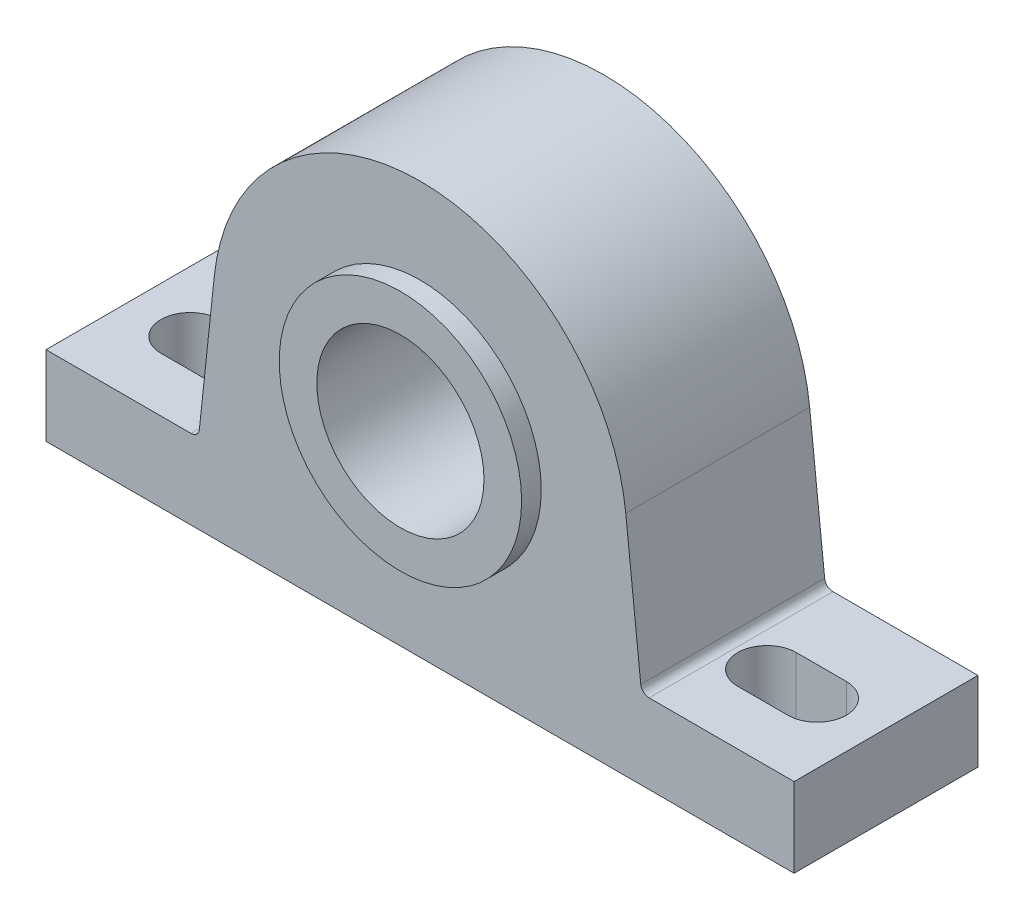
from build123d import *

# Parameters (mm, degrees)
ESQUISSE1_R             = 20
BASE_EXTRUSION_DEPTH    = 44
ENL_V_MAT_EXTRU_1_DEPTH = 44
BOSS_EXTRU_1_START      = 4.7
ESQUISSE3_R             = 29
ESQUISSE3_R_2           = 20
BOSS_EXTRU_1_DEPTH      = 4.7


with BuildPart() as part:
    # Esquisse1 → Base-Extrusion (new body)
    with BuildSketch(Plane.XY):
        with BuildLine():
            Line((-89.5, -49.2), (89.5, -49.2))
            Line((89.5, -49.2), (89.5, -30.2))
            Line((89.5, -30.2), (54.798120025, -30.2))
            ThreePointArc((54.798120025, -30.2), (53.460963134, -29.687283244), (52.809388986, -28.412011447))
            Line((52.809388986, -28.412011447), (49.220803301, 5.25))
            ThreePointArc((49.220803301, 5.25), (0, 49.499999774), (-49.220803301, 5.25))
            Line((-49.220803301, 5.25), (-52.809117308, -28.4100804))
            ThreePointArc((-52.809117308, -28.4100804), (-53.460729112, -29.685389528), (-54.797952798, -30.198072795))
            Line((-54.797952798, -30.198072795), (-89.5, -30.198072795))
            Line((-89.5, -30.198072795), (-89.5, -49.2))
        make_face()
        Circle(ESQUISSE1_R, mode=Mode.SUBTRACT)
    extrude(amount=-BASE_EXTRUSION_DEPTH)

    # Esquisse2 → Enl_v. mat.-Extru.1 (cut)
    with BuildSketch(Plane(origin=(0, -30.198072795, 0), x_dir=(-1, 0, 0), z_dir=(0, 1, 0))):
        with BuildLine():
            Line((75, -27), (63, -27))
            ThreePointArc((63, -27), (56, -20), (63, -13))
            Line((63, -13), (75, -13))
            ThreePointArc((75, -13), (82, -20), (75, -27))
        make_face()
        with BuildLine():
            Line((-63, -27), (-75, -27))
            ThreePointArc((-75, -27), (-82, -20), (-75, -13))
            Line((-75, -13), (-63, -13))
            ThreePointArc((-63, -13), (-56, -20), (-63, -27))
        make_face()
    extrude(amount=-ENL_V_MAT_EXTRU_1_DEPTH, mode=Mode.SUBTRACT)

    # Esquisse3 → Boss.-Extru.1 (add)
    with BuildSketch(Plane.XY.offset(BOSS_EXTRU_1_START)):
        Circle(ESQUISSE3_R)
        Circle(ESQUISSE3_R_2, mode=Mode.SUBTRACT)
    extrude(amount=-BOSS_EXTRU_1_DEPTH)


solid = part.part
